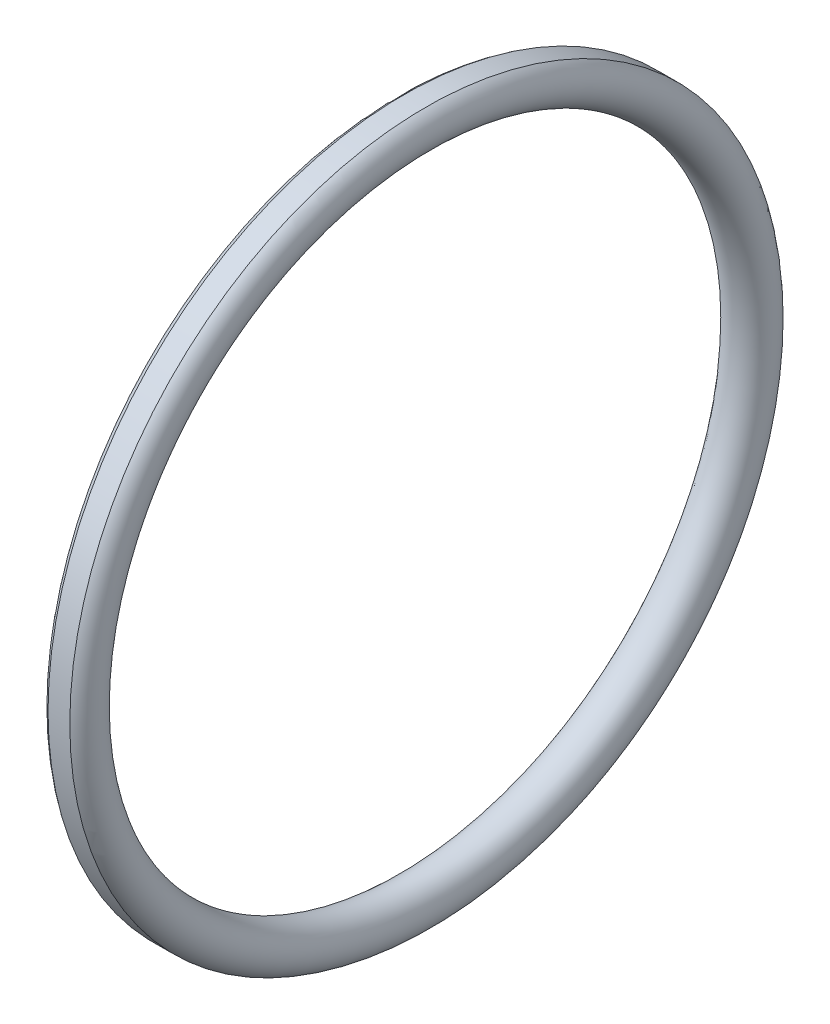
from build123d import *


with BuildPart() as part:
    # Esquisse1 → Base-R_volution (revolve)
    with BuildSketch(Plane.XY, mode=Mode.PRIVATE) as base_r_volution_sk:
        with BuildLine():
            Line((-0.871206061, 28.5), (0.871206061, 28.5))
            ThreePointArc((0.871206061, 28.5), (1.272052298, 25.741436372), (-1.5, 26.034825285))
            Line((-1.5, 26.034825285), (-1.5, 27.895174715))
            ThreePointArc((-1.5, 27.895174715), (-1.223563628, 28.237052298), (-0.871206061, 28.5))
        make_face()
    revolve(base_r_volution_sk.sketch.rotate(Axis((-14.950632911, 0, 0), (1, 0, 0)), 90), axis=Axis((-14.950632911, 0, 0), (1, 0, 0)))


solid = part.part
